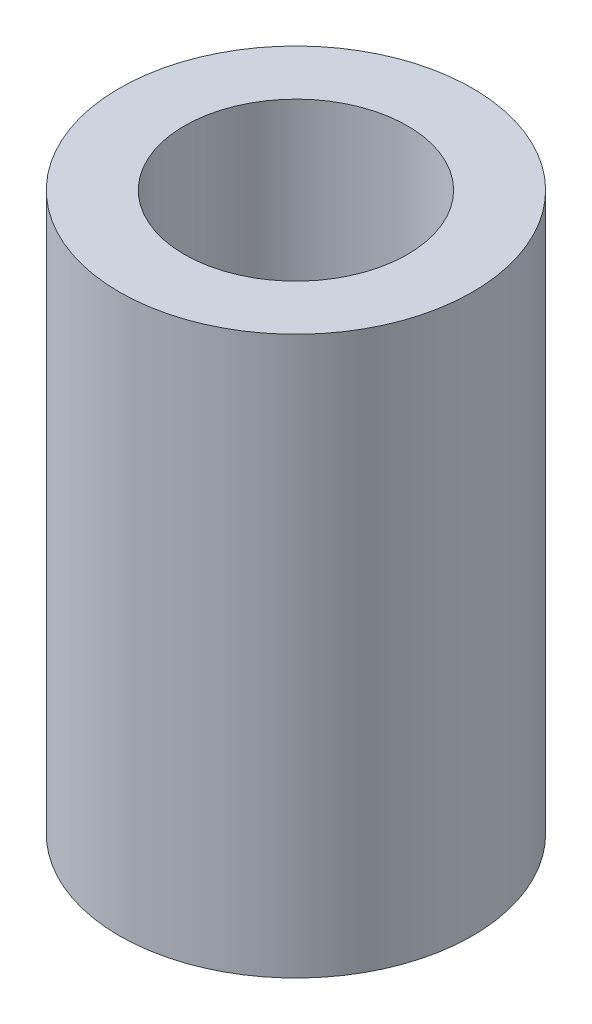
ISO-10303-21;
HEADER;
FILE_DESCRIPTION(('STEP AP214'),'2;1');
FILE_NAME('part.step','',(''),(''),'','','');
FILE_SCHEMA(('AUTOMOTIVE_DESIGN { 1 0 10303 214 1 1 1 1 }'));
ENDSEC;
DATA;
#1=APPLICATION_CONTEXT('core data for automotive mechanical design processes');
#2=APPLICATION_PROTOCOL_DEFINITION('international standard','automotive_design',2000,#1);
#3=PRODUCT_CONTEXT('',#1,'mechanical');
#4=PRODUCT('Part','Part','',(#3));
#5=PRODUCT_RELATED_PRODUCT_CATEGORY('part','',(#4));
#6=PRODUCT_DEFINITION_FORMATION('','',#4);
#7=PRODUCT_DEFINITION_CONTEXT('part definition',#1,'design');
#8=PRODUCT_DEFINITION('design','',#6,#7);
#9=PRODUCT_DEFINITION_SHAPE('','',#8);
#10=(LENGTH_UNIT() NAMED_UNIT(*) SI_UNIT(.MILLI.,.METRE.));
#11=(NAMED_UNIT(*) PLANE_ANGLE_UNIT() SI_UNIT($,.RADIAN.));
#12=(NAMED_UNIT(*) SI_UNIT($,.STERADIAN.) SOLID_ANGLE_UNIT());
#13=UNCERTAINTY_MEASURE_WITH_UNIT(LENGTH_MEASURE(1.E-05),#10,'distance_accuracy_value','');
#14=(GEOMETRIC_REPRESENTATION_CONTEXT(3) GLOBAL_UNCERTAINTY_ASSIGNED_CONTEXT((#13)) GLOBAL_UNIT_ASSIGNED_CONTEXT((#10,
#11,#12)) REPRESENTATION_CONTEXT('',''));
#15=CARTESIAN_POINT('',(0.,0.,0.));
#16=DIRECTION('',(0.,0.,1.));
#17=DIRECTION('',(1.,0.,0.));
#18=AXIS2_PLACEMENT_3D('',#15,#16,#17);
#19=CARTESIAN_POINT('',(0.,30.,0.));
#20=DIRECTION('',(0.,1.,0.));
#21=DIRECTION('',(0.,0.,1.));
#22=AXIS2_PLACEMENT_3D('',#19,#20,#21);
#23=PLANE('',#22);
#24=CARTESIAN_POINT('',(0.,30.,0.));
#25=DIRECTION('',(0.,1.,0.));
#26=DIRECTION('',(0.,0.,1.));
#27=AXIS2_PLACEMENT_3D('',#24,#25,#26);
#28=CIRCLE('',#27,9.5);
#29=CARTESIAN_POINT('',(0.,30.,9.5));
#30=VERTEX_POINT('',#29);
#31=EDGE_CURVE('E10',#30,#30,#28,.T.);
#32=ORIENTED_EDGE('',*,*,#31,.T.);
#33=EDGE_LOOP('',(#32));
#34=FACE_BOUND('',#33,.T.);
#35=CARTESIAN_POINT('',(0.,30.,0.));
#36=DIRECTION('',(0.,1.,0.));
#37=DIRECTION('',(0.,0.,1.));
#38=AXIS2_PLACEMENT_3D('',#35,#36,#37);
#39=CIRCLE('',#38,6.);
#40=CARTESIAN_POINT('',(0.,30.,6.));
#41=VERTEX_POINT('',#40);
#42=EDGE_CURVE('E39',#41,#41,#39,.T.);
#43=ORIENTED_EDGE('',*,*,#42,.F.);
#44=EDGE_LOOP('',(#43));
#45=FACE_BOUND('',#44,.T.);
#46=ADVANCED_FACE('F28',(#34,#45),#23,.T.);
#47=CARTESIAN_POINT('',(0.,0.,0.));
#48=DIRECTION('',(0.,1.,0.));
#49=DIRECTION('',(0.,0.,1.));
#50=AXIS2_PLACEMENT_3D('',#47,#48,#49);
#51=PLANE('',#50);
#52=CARTESIAN_POINT('',(0.,0.,0.));
#53=DIRECTION('',(0.,1.,0.));
#54=DIRECTION('',(0.,0.,1.));
#55=AXIS2_PLACEMENT_3D('',#52,#53,#54);
#56=CIRCLE('',#55,9.5);
#57=CARTESIAN_POINT('',(0.,0.,9.5));
#58=VERTEX_POINT('',#57);
#59=EDGE_CURVE('E35',#58,#58,#56,.T.);
#60=ORIENTED_EDGE('',*,*,#59,.F.);
#61=EDGE_LOOP('',(#60));
#62=FACE_BOUND('',#61,.T.);
#63=CARTESIAN_POINT('',(0.,0.,0.));
#64=DIRECTION('',(0.,1.,0.));
#65=DIRECTION('',(0.,0.,1.));
#66=AXIS2_PLACEMENT_3D('',#63,#64,#65);
#67=CIRCLE('',#66,6.);
#68=CARTESIAN_POINT('',(0.,0.,6.));
#69=VERTEX_POINT('',#68);
#70=EDGE_CURVE('E43',#69,#69,#67,.T.);
#71=ORIENTED_EDGE('',*,*,#70,.T.);
#72=EDGE_LOOP('',(#71));
#73=FACE_BOUND('',#72,.T.);
#74=ADVANCED_FACE('F49',(#62,#73),#51,.F.);
#75=CARTESIAN_POINT('',(0.,30.,0.));
#76=DIRECTION('',(0.,-1.,0.));
#77=DIRECTION('',(0.,0.,-1.));
#78=AXIS2_PLACEMENT_3D('',#75,#76,#77);
#79=CYLINDRICAL_SURFACE('',#78,9.5);
#80=ORIENTED_EDGE('',*,*,#31,.F.);
#81=EDGE_LOOP('',(#80));
#82=FACE_BOUND('',#81,.T.);
#83=ORIENTED_EDGE('',*,*,#59,.T.);
#84=EDGE_LOOP('',(#83));
#85=FACE_BOUND('',#84,.T.);
#86=ADVANCED_FACE('F30',(#82,#85),#79,.T.);
#87=CARTESIAN_POINT('',(0.,30.,0.));
#88=DIRECTION('',(0.,-1.,0.));
#89=DIRECTION('',(0.,0.,-1.));
#90=AXIS2_PLACEMENT_3D('',#87,#88,#89);
#91=CYLINDRICAL_SURFACE('',#90,6.);
#92=ORIENTED_EDGE('',*,*,#42,.T.);
#93=EDGE_LOOP('',(#92));
#94=FACE_BOUND('',#93,.T.);
#95=ORIENTED_EDGE('',*,*,#70,.F.);
#96=EDGE_LOOP('',(#95));
#97=FACE_BOUND('',#96,.T.);
#98=ADVANCED_FACE('F51',(#94,#97),#91,.F.);
#99=CLOSED_SHELL('',(#46,#74,#86,#98));
#100=MANIFOLD_SOLID_BREP('B2',#99);
#101=ADVANCED_BREP_SHAPE_REPRESENTATION('',(#18,#100),#14);
#102=SHAPE_DEFINITION_REPRESENTATION(#9,#101);
ENDSEC;
END-ISO-10303-21;
